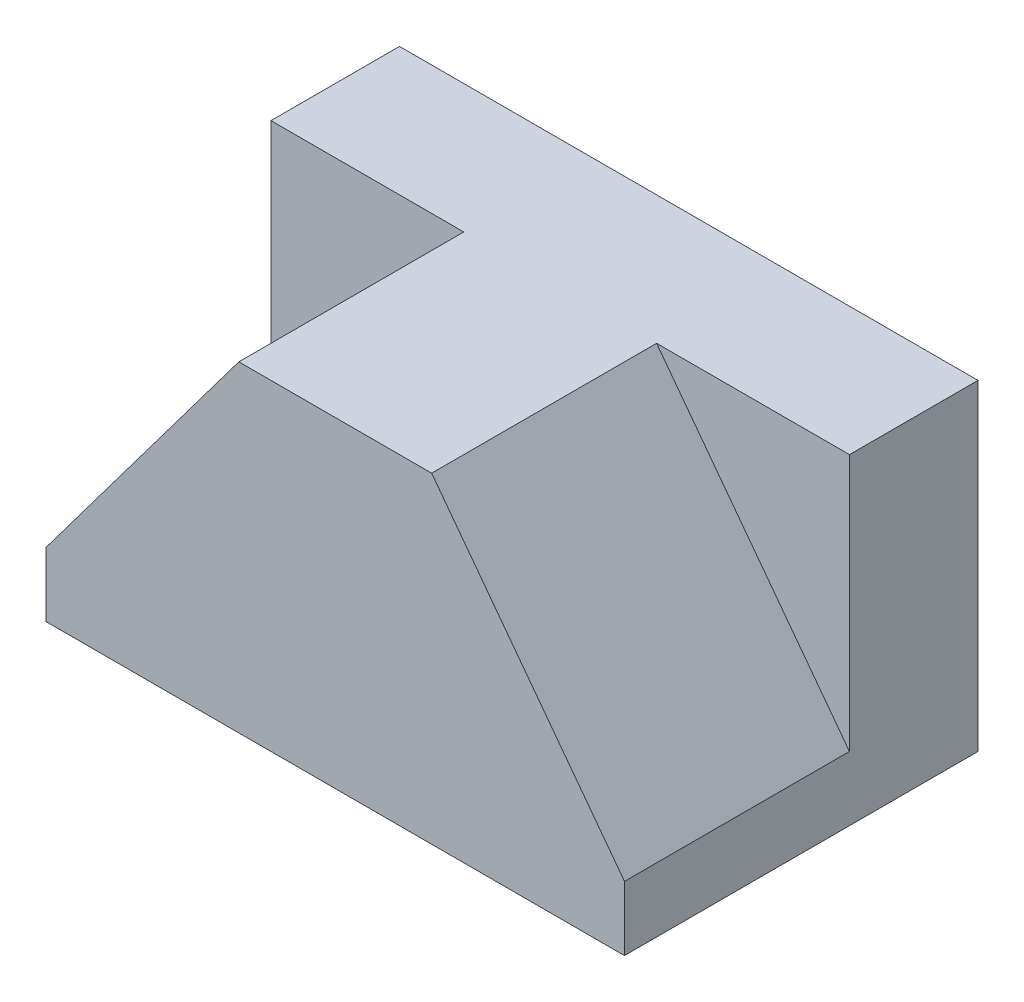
ISO-10303-21;
HEADER;
FILE_DESCRIPTION(('STEP AP214'),'2;1');
FILE_NAME('part.step','',(''),(''),'','','');
FILE_SCHEMA(('AUTOMOTIVE_DESIGN { 1 0 10303 214 1 1 1 1 }'));
ENDSEC;
DATA;
#1=APPLICATION_CONTEXT('core data for automotive mechanical design processes');
#2=APPLICATION_PROTOCOL_DEFINITION('international standard','automotive_design',2000,#1);
#3=PRODUCT_CONTEXT('',#1,'mechanical');
#4=PRODUCT('Part','Part','',(#3));
#5=PRODUCT_RELATED_PRODUCT_CATEGORY('part','',(#4));
#6=PRODUCT_DEFINITION_FORMATION('','',#4);
#7=PRODUCT_DEFINITION_CONTEXT('part definition',#1,'design');
#8=PRODUCT_DEFINITION('design','',#6,#7);
#9=PRODUCT_DEFINITION_SHAPE('','',#8);
#10=(LENGTH_UNIT() NAMED_UNIT(*) SI_UNIT(.MILLI.,.METRE.));
#11=(NAMED_UNIT(*) PLANE_ANGLE_UNIT() SI_UNIT($,.RADIAN.));
#12=(NAMED_UNIT(*) SI_UNIT($,.STERADIAN.) SOLID_ANGLE_UNIT());
#13=UNCERTAINTY_MEASURE_WITH_UNIT(LENGTH_MEASURE(1.E-05),#10,'distance_accuracy_value','');
#14=(GEOMETRIC_REPRESENTATION_CONTEXT(3) GLOBAL_UNCERTAINTY_ASSIGNED_CONTEXT((#13)) GLOBAL_UNIT_ASSIGNED_CONTEXT((#10,
#11,#12)) REPRESENTATION_CONTEXT('',''));
#15=CARTESIAN_POINT('',(0.,0.,0.));
#16=DIRECTION('',(0.,0.,1.));
#17=DIRECTION('',(1.,0.,0.));
#18=AXIS2_PLACEMENT_3D('',#15,#16,#17);
#19=CARTESIAN_POINT('',(0.,50.,0.));
#20=DIRECTION('',(1.,0.,0.));
#21=DIRECTION('',(0.,0.,-1.));
#22=AXIS2_PLACEMENT_3D('',#19,#20,#21);
#23=PLANE('',#22);
#24=DIRECTION('',(0.,-1.,0.));
#25=VECTOR('',#24,1.);
#26=CARTESIAN_POINT('',(0.,50.,0.));
#27=LINE('',#26,#25);
#28=CARTESIAN_POINT('',(0.,10.,0.));
#29=VERTEX_POINT('',#28);
#30=CARTESIAN_POINT('',(0.,0.,0.));
#31=VERTEX_POINT('',#30);
#32=EDGE_CURVE('E11',#29,#31,#27,.T.);
#33=ORIENTED_EDGE('',*,*,#32,.F.);
#34=DIRECTION('',(0.,0.,1.));
#35=VECTOR('',#34,1.);
#36=CARTESIAN_POINT('',(0.,10.,-35.));
#37=LINE('',#36,#35);
#38=CARTESIAN_POINT('',(0.,10.,-35.));
#39=VERTEX_POINT('',#38);
#40=EDGE_CURVE('E123',#39,#29,#37,.T.);
#41=ORIENTED_EDGE('',*,*,#40,.F.);
#42=DIRECTION('',(0.,-1.,0.));
#43=VECTOR('',#42,1.);
#44=CARTESIAN_POINT('',(0.,10.,-35.));
#45=LINE('',#44,#43);
#46=CARTESIAN_POINT('',(0.,50.,-35.));
#47=VERTEX_POINT('',#46);
#48=EDGE_CURVE('E118',#47,#39,#45,.T.);
#49=ORIENTED_EDGE('',*,*,#48,.F.);
#50=DIRECTION('',(0.,0.,1.));
#51=VECTOR('',#50,1.);
#52=CARTESIAN_POINT('',(0.,50.,0.));
#53=LINE('',#52,#51);
#54=CARTESIAN_POINT('',(0.,50.,-55.));
#55=VERTEX_POINT('',#54);
#56=EDGE_CURVE('E130',#55,#47,#53,.T.);
#57=ORIENTED_EDGE('',*,*,#56,.F.);
#58=DIRECTION('',(0.,-1.,0.));
#59=VECTOR('',#58,1.);
#60=CARTESIAN_POINT('',(0.,50.,-55.));
#61=LINE('',#60,#59);
#62=CARTESIAN_POINT('',(0.,0.,-55.));
#63=VERTEX_POINT('',#62);
#64=EDGE_CURVE('E140',#55,#63,#61,.T.);
#65=ORIENTED_EDGE('',*,*,#64,.T.);
#66=DIRECTION('',(0.,0.,1.));
#67=VECTOR('',#66,1.);
#68=CARTESIAN_POINT('',(0.,0.,0.));
#69=LINE('',#68,#67);
#70=EDGE_CURVE('E128',#63,#31,#69,.T.);
#71=ORIENTED_EDGE('',*,*,#70,.T.);
#72=EDGE_LOOP('',(#33,#41,#49,#57,#65,#71));
#73=FACE_BOUND('',#72,.T.);
#74=ADVANCED_FACE('F31',(#73),#23,.F.);
#75=CARTESIAN_POINT('',(0.,50.,0.));
#76=DIRECTION('',(0.,0.,-1.));
#77=DIRECTION('',(-1.,0.,0.));
#78=AXIS2_PLACEMENT_3D('',#75,#76,#77);
#79=PLANE('',#78);
#80=DIRECTION('',(0.,-1.,0.));
#81=VECTOR('',#80,1.);
#82=CARTESIAN_POINT('',(90.,50.,0.));
#83=LINE('',#82,#81);
#84=CARTESIAN_POINT('',(90.,10.,0.));
#85=VERTEX_POINT('',#84);
#86=CARTESIAN_POINT('',(90.,0.,0.));
#87=VERTEX_POINT('',#86);
#88=EDGE_CURVE('E38',#85,#87,#83,.T.);
#89=ORIENTED_EDGE('',*,*,#88,.F.);
#90=DIRECTION('',(0.6,-0.8,0.));
#91=VECTOR('',#90,1.);
#92=CARTESIAN_POINT('',(60.,50.,0.));
#93=LINE('',#92,#91);
#94=CARTESIAN_POINT('',(60.,50.,0.));
#95=VERTEX_POINT('',#94);
#96=EDGE_CURVE('E99',#95,#85,#93,.T.);
#97=ORIENTED_EDGE('',*,*,#96,.F.);
#98=DIRECTION('',(1.,0.,0.));
#99=VECTOR('',#98,1.);
#100=CARTESIAN_POINT('',(0.,50.,0.));
#101=LINE('',#100,#99);
#102=CARTESIAN_POINT('',(30.,50.,0.));
#103=VERTEX_POINT('',#102);
#104=EDGE_CURVE('E133',#103,#95,#101,.T.);
#105=ORIENTED_EDGE('',*,*,#104,.F.);
#106=DIRECTION('',(0.6,0.8,0.));
#107=VECTOR('',#106,1.);
#108=CARTESIAN_POINT('',(30.,50.,0.));
#109=LINE('',#108,#107);
#110=EDGE_CURVE('E116',#29,#103,#109,.T.);
#111=ORIENTED_EDGE('',*,*,#110,.F.);
#112=ORIENTED_EDGE('',*,*,#32,.T.);
#113=DIRECTION('',(1.,0.,0.));
#114=VECTOR('',#113,1.);
#115=CARTESIAN_POINT('',(0.,0.,0.));
#116=LINE('',#115,#114);
#117=EDGE_CURVE('E143',#31,#87,#116,.T.);
#118=ORIENTED_EDGE('',*,*,#117,.T.);
#119=EDGE_LOOP('',(#89,#97,#105,#111,#112,#118));
#120=FACE_BOUND('',#119,.T.);
#121=ADVANCED_FACE('F156',(#120),#79,.F.);
#122=CARTESIAN_POINT('',(90.,50.,0.));
#123=DIRECTION('',(-1.,0.,0.));
#124=DIRECTION('',(0.,0.,1.));
#125=AXIS2_PLACEMENT_3D('',#122,#123,#124);
#126=PLANE('',#125);
#127=DIRECTION('',(0.,1.,0.));
#128=VECTOR('',#127,1.);
#129=CARTESIAN_POINT('',(90.,10.,-35.));
#130=LINE('',#129,#128);
#131=CARTESIAN_POINT('',(90.,10.,-35.));
#132=VERTEX_POINT('',#131);
#133=CARTESIAN_POINT('',(90.,50.,-35.));
#134=VERTEX_POINT('',#133);
#135=EDGE_CURVE('E45',#132,#134,#130,.T.);
#136=ORIENTED_EDGE('',*,*,#135,.F.);
#137=DIRECTION('',(0.,0.,1.));
#138=VECTOR('',#137,1.);
#139=CARTESIAN_POINT('',(90.,10.,-35.));
#140=LINE('',#139,#138);
#141=EDGE_CURVE('E95',#132,#85,#140,.T.);
#142=ORIENTED_EDGE('',*,*,#141,.T.);
#143=ORIENTED_EDGE('',*,*,#88,.T.);
#144=DIRECTION('',(0.,0.,-1.));
#145=VECTOR('',#144,1.);
#146=CARTESIAN_POINT('',(90.,0.,0.));
#147=LINE('',#146,#145);
#148=CARTESIAN_POINT('',(90.,0.,-55.));
#149=VERTEX_POINT('',#148);
#150=EDGE_CURVE('E146',#87,#149,#147,.T.);
#151=ORIENTED_EDGE('',*,*,#150,.T.);
#152=DIRECTION('',(0.,-1.,0.));
#153=VECTOR('',#152,1.);
#154=CARTESIAN_POINT('',(90.,50.,-55.));
#155=LINE('',#154,#153);
#156=CARTESIAN_POINT('',(90.,50.,-55.));
#157=VERTEX_POINT('',#156);
#158=EDGE_CURVE('E151',#157,#149,#155,.T.);
#159=ORIENTED_EDGE('',*,*,#158,.F.);
#160=DIRECTION('',(0.,0.,-1.));
#161=VECTOR('',#160,1.);
#162=CARTESIAN_POINT('',(90.,50.,0.));
#163=LINE('',#162,#161);
#164=EDGE_CURVE('E111',#134,#157,#163,.T.);
#165=ORIENTED_EDGE('',*,*,#164,.F.);
#166=EDGE_LOOP('',(#136,#142,#143,#151,#159,#165));
#167=FACE_BOUND('',#166,.T.);
#168=ADVANCED_FACE('F109',(#167),#126,.F.);
#169=CARTESIAN_POINT('',(0.,50.,-55.));
#170=DIRECTION('',(0.,0.,1.));
#171=DIRECTION('',(1.,0.,0.));
#172=AXIS2_PLACEMENT_3D('',#169,#170,#171);
#173=PLANE('',#172);
#174=DIRECTION('',(-1.,0.,0.));
#175=VECTOR('',#174,1.);
#176=CARTESIAN_POINT('',(0.,0.,-55.));
#177=LINE('',#176,#175);
#178=EDGE_CURVE('E134',#149,#63,#177,.T.);
#179=ORIENTED_EDGE('',*,*,#178,.T.);
#180=ORIENTED_EDGE('',*,*,#64,.F.);
#181=DIRECTION('',(-1.,0.,0.));
#182=VECTOR('',#181,1.);
#183=CARTESIAN_POINT('',(0.,50.,-55.));
#184=LINE('',#183,#182);
#185=EDGE_CURVE('E138',#157,#55,#184,.T.);
#186=ORIENTED_EDGE('',*,*,#185,.F.);
#187=ORIENTED_EDGE('',*,*,#158,.T.);
#188=EDGE_LOOP('',(#179,#180,#186,#187));
#189=FACE_BOUND('',#188,.T.);
#190=ADVANCED_FACE('F165',(#189),#173,.F.);
#191=CARTESIAN_POINT('',(0.,50.,-55.));
#192=DIRECTION('',(0.,-1.,0.));
#193=DIRECTION('',(0.,0.,-1.));
#194=AXIS2_PLACEMENT_3D('',#191,#192,#193);
#195=PLANE('',#194);
#196=ORIENTED_EDGE('',*,*,#104,.T.);
#197=DIRECTION('',(0.,0.,1.));
#198=VECTOR('',#197,1.);
#199=CARTESIAN_POINT('',(60.,50.,-35.));
#200=LINE('',#199,#198);
#201=CARTESIAN_POINT('',(60.,50.,-35.));
#202=VERTEX_POINT('',#201);
#203=EDGE_CURVE('E102',#202,#95,#200,.T.);
#204=ORIENTED_EDGE('',*,*,#203,.F.);
#205=DIRECTION('',(-1.,0.,0.));
#206=VECTOR('',#205,1.);
#207=CARTESIAN_POINT('',(90.,50.,-35.));
#208=LINE('',#207,#206);
#209=EDGE_CURVE('E103',#134,#202,#208,.T.);
#210=ORIENTED_EDGE('',*,*,#209,.F.);
#211=ORIENTED_EDGE('',*,*,#164,.T.);
#212=ORIENTED_EDGE('',*,*,#185,.T.);
#213=ORIENTED_EDGE('',*,*,#56,.T.);
#214=DIRECTION('',(-1.,0.,0.));
#215=VECTOR('',#214,1.);
#216=CARTESIAN_POINT('',(0.,50.,-35.));
#217=LINE('',#216,#215);
#218=CARTESIAN_POINT('',(30.,50.,-35.));
#219=VERTEX_POINT('',#218);
#220=EDGE_CURVE('E121',#219,#47,#217,.T.);
#221=ORIENTED_EDGE('',*,*,#220,.F.);
#222=DIRECTION('',(0.,0.,1.));
#223=VECTOR('',#222,1.);
#224=CARTESIAN_POINT('',(30.,50.,-35.));
#225=LINE('',#224,#223);
#226=EDGE_CURVE('E125',#219,#103,#225,.T.);
#227=ORIENTED_EDGE('',*,*,#226,.T.);
#228=EDGE_LOOP('',(#196,#204,#210,#211,#212,#213,#221,#227));
#229=FACE_BOUND('',#228,.T.);
#230=ADVANCED_FACE('F173',(#229),#195,.F.);
#231=CARTESIAN_POINT('',(0.,0.,-55.));
#232=DIRECTION('',(0.,-1.,0.));
#233=DIRECTION('',(0.,0.,-1.));
#234=AXIS2_PLACEMENT_3D('',#231,#232,#233);
#235=PLANE('',#234);
#236=ORIENTED_EDGE('',*,*,#70,.F.);
#237=ORIENTED_EDGE('',*,*,#178,.F.);
#238=ORIENTED_EDGE('',*,*,#150,.F.);
#239=ORIENTED_EDGE('',*,*,#117,.F.);
#240=EDGE_LOOP('',(#236,#237,#238,#239));
#241=FACE_BOUND('',#240,.T.);
#242=ADVANCED_FACE('F162',(#241),#235,.T.);
#243=CARTESIAN_POINT('',(30.,50.,-35.));
#244=DIRECTION('',(0.8,-0.6,0.));
#245=DIRECTION('',(0.6,0.8,0.));
#246=AXIS2_PLACEMENT_3D('',#243,#244,#245);
#247=PLANE('',#246);
#248=ORIENTED_EDGE('',*,*,#110,.T.);
#249=ORIENTED_EDGE('',*,*,#226,.F.);
#250=DIRECTION('',(0.6,0.8,0.));
#251=VECTOR('',#250,1.);
#252=CARTESIAN_POINT('',(30.,50.,-35.));
#253=LINE('',#252,#251);
#254=EDGE_CURVE('E53',#39,#219,#253,.T.);
#255=ORIENTED_EDGE('',*,*,#254,.F.);
#256=ORIENTED_EDGE('',*,*,#40,.T.);
#257=EDGE_LOOP('',(#248,#249,#255,#256));
#258=FACE_BOUND('',#257,.T.);
#259=ADVANCED_FACE('F176',(#258),#247,.F.);
#260=CARTESIAN_POINT('',(0.,50.,-35.));
#261=DIRECTION('',(0.,0.,-1.));
#262=DIRECTION('',(-1.,0.,0.));
#263=AXIS2_PLACEMENT_3D('',#260,#261,#262);
#264=PLANE('',#263);
#265=ORIENTED_EDGE('',*,*,#48,.T.);
#266=ORIENTED_EDGE('',*,*,#254,.T.);
#267=ORIENTED_EDGE('',*,*,#220,.T.);
#268=EDGE_LOOP('',(#265,#266,#267));
#269=FACE_BOUND('',#268,.T.);
#270=ADVANCED_FACE('F177',(#269),#264,.F.);
#271=CARTESIAN_POINT('',(60.,50.,-35.));
#272=DIRECTION('',(-0.8,-0.6,0.));
#273=DIRECTION('',(0.6,-0.8,0.));
#274=AXIS2_PLACEMENT_3D('',#271,#272,#273);
#275=PLANE('',#274);
#276=ORIENTED_EDGE('',*,*,#96,.T.);
#277=ORIENTED_EDGE('',*,*,#141,.F.);
#278=DIRECTION('',(0.6,-0.8,0.));
#279=VECTOR('',#278,1.);
#280=CARTESIAN_POINT('',(60.,50.,-35.));
#281=LINE('',#280,#279);
#282=EDGE_CURVE('E97',#202,#132,#281,.T.);
#283=ORIENTED_EDGE('',*,*,#282,.F.);
#284=ORIENTED_EDGE('',*,*,#203,.T.);
#285=EDGE_LOOP('',(#276,#277,#283,#284));
#286=FACE_BOUND('',#285,.T.);
#287=ADVANCED_FACE('F96',(#286),#275,.F.);
#288=CARTESIAN_POINT('',(60.,50.,-35.));
#289=DIRECTION('',(0.,0.,-1.));
#290=DIRECTION('',(-1.,0.,0.));
#291=AXIS2_PLACEMENT_3D('',#288,#289,#290);
#292=PLANE('',#291);
#293=ORIENTED_EDGE('',*,*,#282,.T.);
#294=ORIENTED_EDGE('',*,*,#135,.T.);
#295=ORIENTED_EDGE('',*,*,#209,.T.);
#296=EDGE_LOOP('',(#293,#294,#295));
#297=FACE_BOUND('',#296,.T.);
#298=ADVANCED_FACE('F105',(#297),#292,.F.);
#299=CLOSED_SHELL('',(#74,#121,#168,#190,#230,#242,#259,#270,#287,#298));
#300=MANIFOLD_SOLID_BREP('B2',#299);
#301=ADVANCED_BREP_SHAPE_REPRESENTATION('',(#18,#300),#14);
#302=SHAPE_DEFINITION_REPRESENTATION(#9,#301);
ENDSEC;
END-ISO-10303-21;
